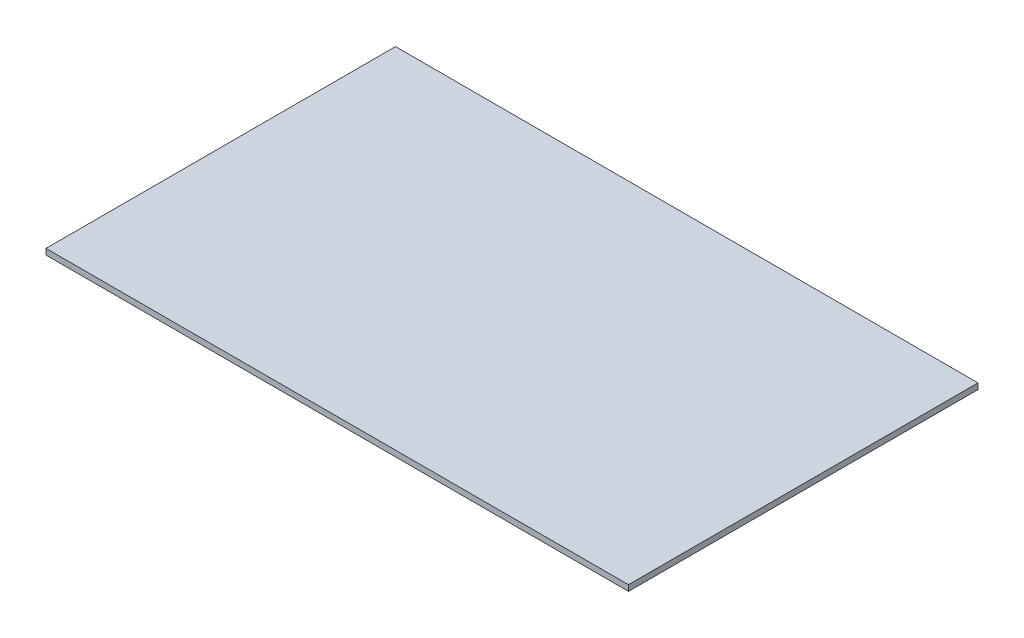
from build123d import *

# Parameters (mm, degrees)
ESQUISSE1_W      = 500
ESQUISSE1_H      = 5
EXTRUSION1_DEPTH = 300


with BuildPart() as part:
    # Esquisse1 → Extrusion1 (new body)
    with BuildSketch(Plane.XY):
        with Locations((250, 2.5)):
            Rectangle(ESQUISSE1_W, ESQUISSE1_H)
    extrude(amount=EXTRUSION1_DEPTH)


solid = part.part
